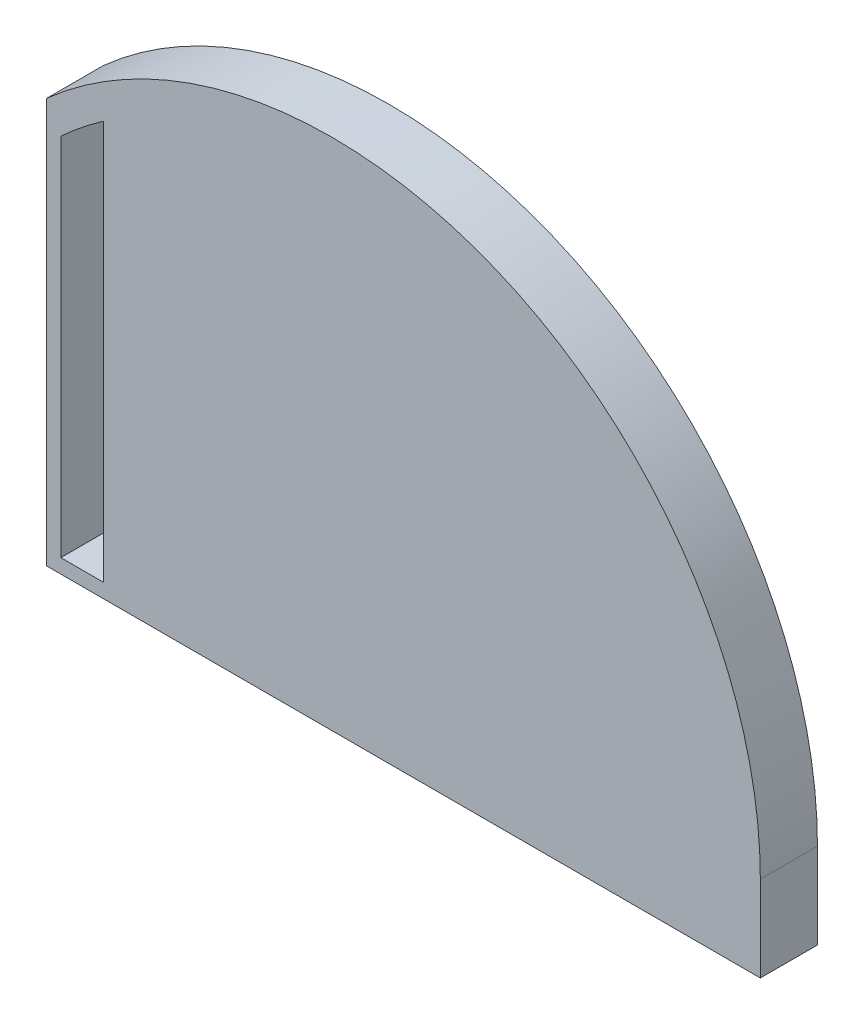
from build123d import *

# Parameters (mm, degrees)
EXTRUDE1_DEPTH     = 20
CUT_EXTRUDE3_DEPTH = 309.706980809


with BuildPart() as part:
    # Sketch1 → Extrude1 (new body)
    with BuildSketch(Plane.XY):
        with BuildLine():
            Line((0, 0), (250, 0))
            Line((250, 0), (250, 30))
            ThreePointArc((250, 30), (161.23724357, 166.930639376), (0, 141.803398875))
            Line((0, 141.803398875), (0, 0))
        make_face()
    extrude(amount=EXTRUDE1_DEPTH)

    # Sketch2 → Cut-Extrude3 (cut, through all)
    with BuildSketch(Plane.XY.offset(20)):
        with BuildLine():
            Line((5, 132.834819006), (5, 5))
            Line((5, 5), (20, 5))
            Line((20, 5), (20, 144.891252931))
            ThreePointArc((20, 144.891252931), (12.292592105, 139.121082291), (5, 132.834819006))
        make_face()
    extrude(amount=-CUT_EXTRUDE3_DEPTH, mode=Mode.SUBTRACT)


solid = part.part
